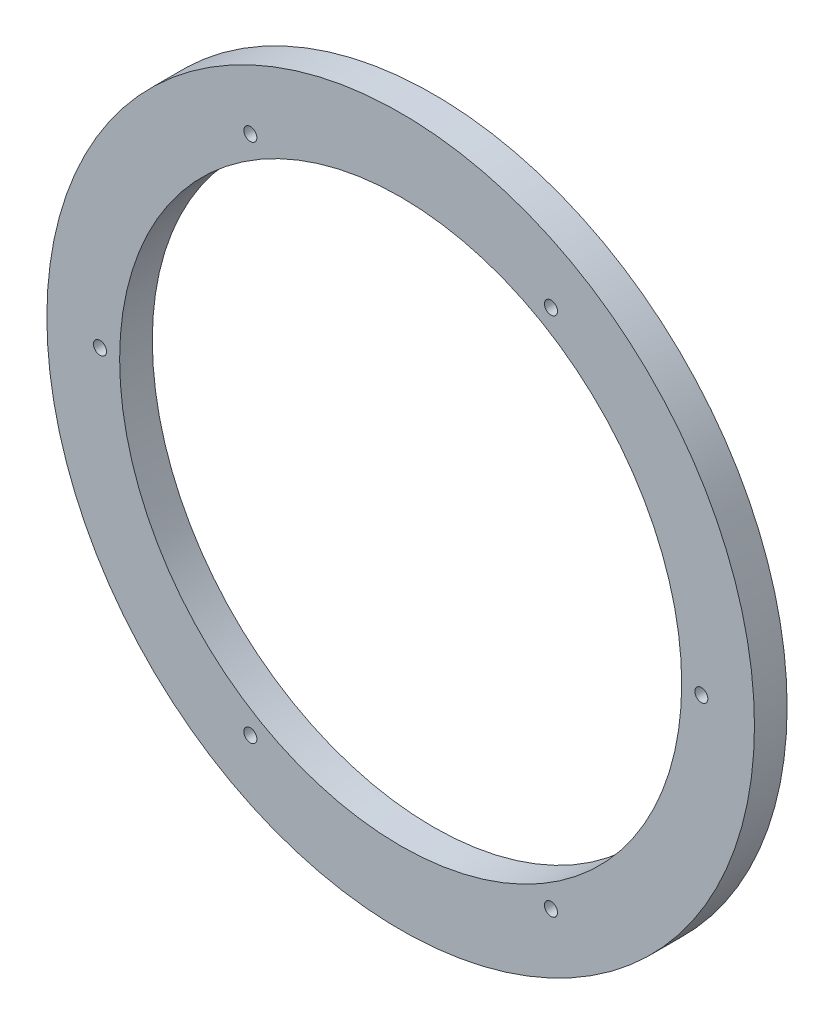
from build123d import *

# Parameters (mm, degrees)
SKETCH1_R              = 103.124
SKETCH1_R_2            = 81.915
BOSS_EXTRUDE1_DEPTH    = 9.525
F_10_24_TAPPED_HOLE1_D = 3.7973


with BuildPart() as part:
    # Sketch1 → Boss-Extrude1 (new body)
    with BuildSketch(Plane.XY):
        Circle(SKETCH1_R)
        Circle(SKETCH1_R_2, mode=Mode.SUBTRACT)
    extrude(amount=-BOSS_EXTRUDE1_DEPTH)

    # 10-24 Tapped Hole1 (through all)
    with Locations(Plane.XY):
        with Locations((-87.63, 0), (-43.8145, 75.890672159), (43.8165, 75.890672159), (87.632, 0), (43.8165, -75.890672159), (-43.8145, -75.890672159)):
            Hole(F_10_24_TAPPED_HOLE1_D / 2)


solid = part.part
